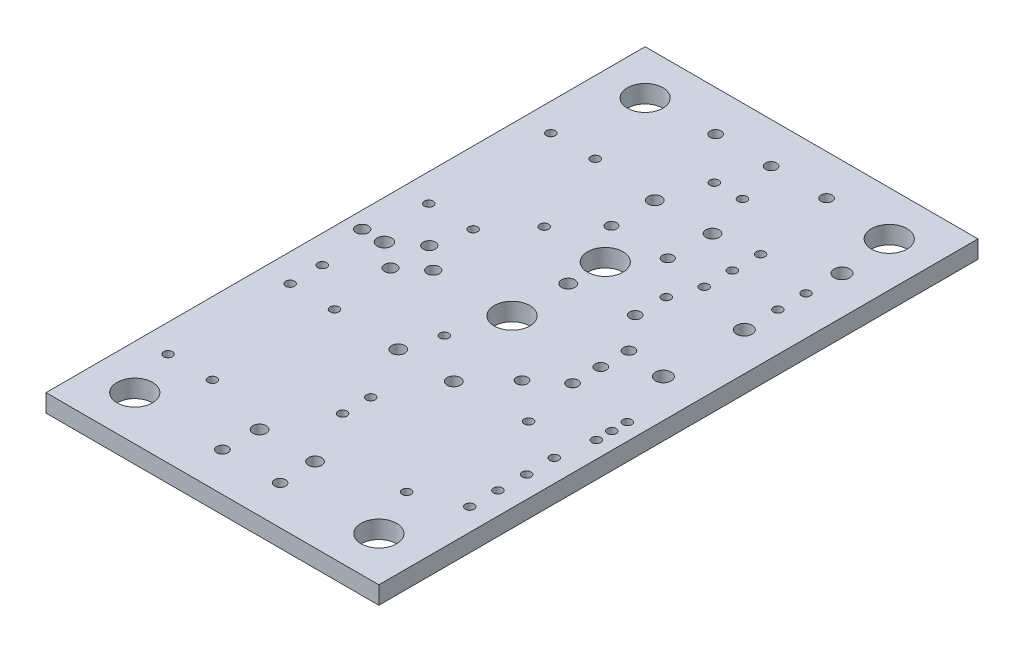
from build123d import *

# Parameters (mm, degrees)
ESQUISSE2_W      = 30
ESQUISSE2_H      = 54
ESQUISSE2_R      = 0.59944
ESQUISSE2_R_2    = 1.6002
ESQUISSE2_R_3    = 0.50038
ESQUISSE2_R_4    = 0.4826
ESQUISSE2_R_5    = 0.39878
ESQUISSE2_R_6    = 0.55118
ESQUISSE2_R_7    = 0.65024
ESQUISSE2_R_8    = 0.70104
ESQUISSE2_R_9    = 0.4
EXTRUSION1_DEPTH = 1.6


with BuildPart() as part:
    # Esquisse2 → Extrusion1 (new body)
    with BuildSketch(Plane(origin=(0, 0, 0), x_dir=(1, 0, 0), z_dir=(0, 1, 0))):
        with Locations((15, 27)):
            Rectangle(ESQUISSE2_W, ESQUISSE2_H)
        with Locations(Location((17.62252, 42.44594, 0), (0, 0, 270))):
            Circle(ESQUISSE2_R, mode=Mode.SUBTRACT)
        with Locations(Location((12.4206, 42.44594, 0), (0, 0, 270))):
            Circle(ESQUISSE2_R, mode=Mode.SUBTRACT)
        with Locations(Location((15.02156, 32.04464, 0), (0, 0, 270))):
            Circle(ESQUISSE2_R, mode=Mode.SUBTRACT)
        with Locations(Location((15.00378, 35.40252, 0), (0, 0, 270))):
            Circle(ESQUISSE2_R_2, mode=Mode.SUBTRACT)
        with Locations(Location((17.59966, 3.50012, 0), (0, 0, 270))):
            Circle(ESQUISSE2_R_3, mode=Mode.SUBTRACT)
        with Locations(Location((12.40028, 3.50012, 0), (0, 0, 270))):
            Circle(ESQUISSE2_R_3, mode=Mode.SUBTRACT)
        with Locations(Location((15.00124, 50.35042, 0), (0, 0, 270))):
            Circle(ESQUISSE2_R_3, mode=Mode.SUBTRACT)
        with Locations(Location((19.99996, 50.35042, 0), (0, 0, 270))):
            Circle(ESQUISSE2_R_3, mode=Mode.SUBTRACT)
        with Locations(Location((9.99998, 50.35042, 0), (0, 0, 270))):
            Circle(ESQUISSE2_R_3, mode=Mode.SUBTRACT)
        with Locations(Location((12.49934, 19.25066, 0), (0, 0, 270))):
            Circle(ESQUISSE2_R, mode=Mode.SUBTRACT)
        with Locations(Location((12.49934, 6.74878, 0), (0, 0, 270))):
            Circle(ESQUISSE2_R, mode=Mode.SUBTRACT)
        with Locations(Location((17.5006, 19.25066, 0), (0, 0, 270))):
            Circle(ESQUISSE2_R, mode=Mode.SUBTRACT)
        with Locations(Location((17.5006, 6.74878, 0), (0, 0, 270))):
            Circle(ESQUISSE2_R, mode=Mode.SUBTRACT)
        with Locations(Location((20.50034, 22.40026, 0), (0, 0, 270))):
            Circle(ESQUISSE2_R_3, mode=Mode.SUBTRACT)
        with Locations(Location((20.50034, 32.6009, 0), (0, 0, 270))):
            Circle(ESQUISSE2_R_3, mode=Mode.SUBTRACT)
        with Locations(Location((12.46124, 38.49878, 0), (0, 0, 270))):
            Circle(ESQUISSE2_R_4, mode=Mode.SUBTRACT)
        with Locations(Location((17.54124, 38.49878, 0), (0, 0, 270))):
            Circle(ESQUISSE2_R_4, mode=Mode.SUBTRACT)
        with Locations(Location((16.27124, 46.49978, 0), (0, 0, 270))):
            Circle(ESQUISSE2_R_5, mode=Mode.SUBTRACT)
        with Locations(Location((13.73124, 46.49978, 0), (0, 0, 270))):
            Circle(ESQUISSE2_R_5, mode=Mode.SUBTRACT)
        with Locations(Location((15.00124, 11.72972, 0), (0, 0, 270))):
            Circle(ESQUISSE2_R_5, mode=Mode.SUBTRACT)
        with Locations(Location((15.00124, 14.26972, 0), (0, 0, 270))):
            Circle(ESQUISSE2_R_5, mode=Mode.SUBTRACT)
        with Locations(Location((1.4986, 27.0002, 0), (0, 0, 270))):
            Circle(ESQUISSE2_R_6, mode=Mode.SUBTRACT)
        with Locations(Location((7.8994, 27.0002, 0), (0, 0, 270))):
            Circle(ESQUISSE2_R_6, mode=Mode.SUBTRACT)
        with Locations(Location((5.79882, 25.25014, 0), (0, 0, 270))):
            Circle(ESQUISSE2_R_6, mode=Mode.SUBTRACT)
        with Locations(Location((5.79882, 28.75026, 0), (0, 0, 270))):
            Circle(ESQUISSE2_R_6, mode=Mode.SUBTRACT)
        with Locations(Location((3.50012, 27.0002, 0), (0, 0, 270))):
            Circle(ESQUISSE2_R_7, mode=Mode.SUBTRACT)
        with Locations(Location((4.0005, 49.9999, 0), (0, 0, 270))):
            Circle(ESQUISSE2_R_2, mode=Mode.SUBTRACT)
        with Locations(Location((25.99944, 49.9999, 0), (0, 0, 270))):
            Circle(ESQUISSE2_R_2, mode=Mode.SUBTRACT)
        with Locations(Location((4.0005, 4.0005, 0), (0, 0, 270))):
            Circle(ESQUISSE2_R_2, mode=Mode.SUBTRACT)
        with Locations(Location((15.00124, 27.0002, 0), (0, 0, 270))):
            Circle(ESQUISSE2_R_2, mode=Mode.SUBTRACT)
        with Locations(Location((25.99944, 4.0005, 0), (0, 0, 270))):
            Circle(ESQUISSE2_R_2, mode=Mode.SUBTRACT)
        with Locations(Location((22.9997, 24.4602, 0), (0, 0, 270))):
            Circle(ESQUISSE2_R_3, mode=Mode.SUBTRACT)
        with Locations(Location((22.9997, 27.0002, 0), (0, 0, 270))):
            Circle(ESQUISSE2_R_3, mode=Mode.SUBTRACT)
        with Locations(Location((22.9997, 29.5402, 0), (0, 0, 270))):
            Circle(ESQUISSE2_R_3, mode=Mode.SUBTRACT)
        with Locations(Location((28.04922, 15.27048, 0), (0, 0, 270))):
            Circle(ESQUISSE2_R_5, mode=Mode.SUBTRACT)
        with Locations(Location((28.00096, 12.73048, 0), (0, 0, 270))):
            Circle(ESQUISSE2_R_5, mode=Mode.SUBTRACT)
        with Locations(Location((28.00096, 10.19048, 0), (0, 0, 270))):
            Circle(ESQUISSE2_R_5, mode=Mode.SUBTRACT)
        with Locations(Location((28.00096, 17.81048, 0), (0, 0, 270))):
            Circle(ESQUISSE2_R_5, mode=Mode.SUBTRACT)
        with Locations(Location((26.49982, 41.9989, 0), (0, 0, 270))):
            Circle(ESQUISSE2_R_5, mode=Mode.SUBTRACT)
        with Locations(Location((26.49982, 39.4589, 0), (0, 0, 270))):
            Circle(ESQUISSE2_R_5, mode=Mode.SUBTRACT)
        with Locations(Location((26.56078, 45.17898, 0), (0, 0, 270))):
            Circle(ESQUISSE2_R_8, mode=Mode.SUBTRACT)
        with Locations(Location((26.56078, 36.38042, 0), (0, 0, 270))):
            Circle(ESQUISSE2_R_8, mode=Mode.SUBTRACT)
        with Locations(Location((26.56078, 29.08046, 0), (0, 0, 270))):
            Circle(ESQUISSE2_R_8, mode=Mode.SUBTRACT)
        with Locations(Location((24.00046, 8.49884, 0), (0, 0, 270))):
            Circle(ESQUISSE2_R_5, mode=Mode.SUBTRACT)
        with Locations(Location((24.00046, 19.49958, 0), (0, 0, 270))):
            Circle(ESQUISSE2_R_5, mode=Mode.SUBTRACT)
        with Locations(Location((6.49986, 42.99966, 0), (0, 0, 270))):
            Circle(ESQUISSE2_R_5, mode=Mode.SUBTRACT)
        with Locations(Location((6.49986, 31.99892, 0), (0, 0, 270))):
            Circle(ESQUISSE2_R_5, mode=Mode.SUBTRACT)
        with Locations(Location((2.49936, 42.99966, 0), (0, 0, 270))):
            Circle(ESQUISSE2_R_5, mode=Mode.SUBTRACT)
        with Locations(Location((2.49936, 31.99892, 0), (0, 0, 270))):
            Circle(ESQUISSE2_R_5, mode=Mode.SUBTRACT)
        with Locations(Location((6.49986, 8.49884, 0), (0, 0, 270))):
            Circle(ESQUISSE2_R_5, mode=Mode.SUBTRACT)
        with Locations(Location((6.49986, 19.49958, 0), (0, 0, 270))):
            Circle(ESQUISSE2_R_5, mode=Mode.SUBTRACT)
        with Locations(Location((2.49936, 8.49884, 0), (0, 0, 270))):
            Circle(ESQUISSE2_R_5, mode=Mode.SUBTRACT)
        with Locations(Location((2.49936, 19.49958, 0), (0, 0, 270))):
            Circle(ESQUISSE2_R_5, mode=Mode.SUBTRACT)
        with Locations(Location((2.49936, 22.40026, 0), (0, 0, 270))):
            Circle(ESQUISSE2_R_5, mode=Mode.SUBTRACT)
        with Locations(Location((13.5001, 22.40026, 0), (0, 0, 270))):
            Circle(ESQUISSE2_R_5, mode=Mode.SUBTRACT)
        with Locations(Location((28.4988, 21.09978, 0), (0, 0, 270))):
            Circle(ESQUISSE2_R_5, mode=Mode.SUBTRACT)
        with Locations(Location((28.4988, 22.49932, 0), (0, 0, 270))):
            Circle(ESQUISSE2_R_5, mode=Mode.SUBTRACT)
        with Locations(Location((28.4988, 23.89886, 0), (0, 0, 270))):
            Circle(ESQUISSE2_R_5, mode=Mode.SUBTRACT)
        with Locations(Location((21.4, 43, 0), (0, 0, 270))):
            Circle(ESQUISSE2_R_9, mode=Mode.SUBTRACT)
        with Locations(Location((21.4, 40.46, 0), (0, 0, 270))):
            Circle(ESQUISSE2_R_9, mode=Mode.SUBTRACT)
        with Locations(Location((21.4, 37.92, 0), (0, 0, 270))):
            Circle(ESQUISSE2_R_9, mode=Mode.SUBTRACT)
        with Locations(Location((20.5, 35.40252, 0), (0, 0, 270))):
            Circle(ESQUISSE2_R_9, mode=Mode.SUBTRACT)
        with Locations(Location((9.5, 35.40252, 0), (0, 0, 270))):
            Circle(ESQUISSE2_R_9, mode=Mode.SUBTRACT)
    extrude(amount=EXTRUSION1_DEPTH)


solid = part.part
